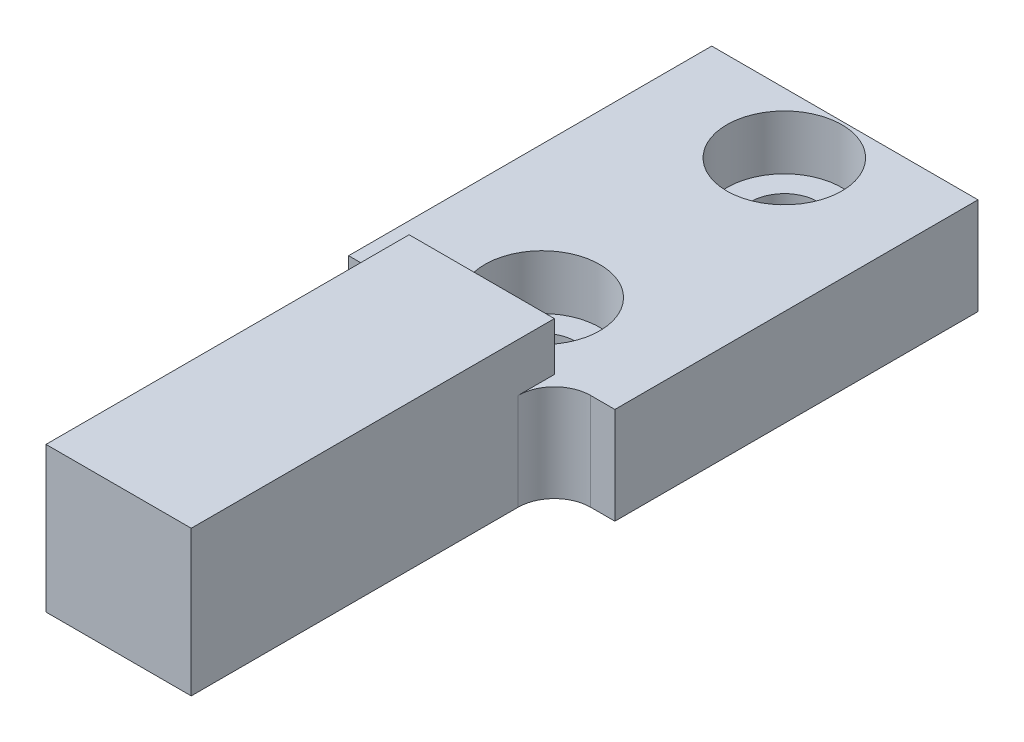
from build123d import *

# Parameters (mm, degrees)
EXTRUDE_1_DEPTH          = 60
SKETCH_2_OUTSIDE_W       = 75.004
SKETCH_2_OUTSIDE_H       = 27.004
CUT_EXTRUDE_1_DEPTH      = 60
CUT_EXTRUDE_2_DEPTH      = 60
CUT_EXTRUDE_2_DEPTH_BACK = 60
SKETCH_3_OUTSIDE_W       = 37.004
SKETCH_3_OUTSIDE_H       = 75.004
SKETCH_3_OUTSIDE_R       = 2.75
SKETCH_4_R               = 4.75
CUT_EXTRUDE_3_DEPTH      = 4.5


with BuildPart() as part:
    # Sketch 1 → Extrude 1 (new body)
    with BuildSketch(Plane.XY):
        Polygon((5, 8), (5, 12), (17, 12), (17, 8), (22, 8), (22, 0), (0, 0), (0, 8), align=None)
    extrude(amount=EXTRUDE_1_DEPTH)

    # Sketch 2 outside → Cut-Extrude 1 (cut)
    with BuildSketch(Plane(origin=(22, 0, 0), x_dir=(0, 0, -1), z_dir=(1, 0, 0))):
        with Locations((-30, 6)):
            Rectangle(SKETCH_2_OUTSIDE_W, SKETCH_2_OUTSIDE_H)
        Polygon((0, 0), (0, 8), (-30, 8), (-30, 12), (-60, 12), (-60, 0), align=None, mode=Mode.SUBTRACT)
    extrude(amount=-CUT_EXTRUDE_1_DEPTH, mode=Mode.SUBTRACT)

    # Sketch 3 outside → Cut-Extrude 2 (cut, two sides: drawn at the far end of the back side and taken through both)
    # profile 1 of 3: a face of its own
    with BuildSketch(Plane(origin=(0, 12, 0), x_dir=(1, 0, 0), z_dir=(0, 1, 0)).offset(-CUT_EXTRUDE_2_DEPTH_BACK)):
        with Locations((11, -30)):
            Rectangle(SKETCH_3_OUTSIDE_W, SKETCH_3_OUTSIDE_H)
        with BuildLine():
            Line((17, -60), (17, -33))
            ThreePointArc((17, -33), (17.878679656, -30.878679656), (20, -30))
            Line((20, -30), (22, -30))
            Line((22, -30), (22, 0))
            Line((22, 0), (0, 0))
            Line((0, 0), (0, -30))
            Line((0, -30), (2, -30))
            ThreePointArc((2, -30), (4.121320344, -30.878679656), (5, -33))
            Line((5, -33), (5, -60))
            Line((5, -60), (17, -60))
        make_face(mode=Mode.SUBTRACT)
    # profile 2 of 3: a face of its own
    with BuildSketch(Plane(origin=(0, 12, 0), x_dir=(1, 0, 0), z_dir=(0, 1, 0)).offset(-CUT_EXTRUDE_2_DEPTH_BACK)):
        with Locations(Location((11, -5, 0), (0, 0, 90))):
            Circle(SKETCH_3_OUTSIDE_R)
    # profile 3 of 3: a face of its own
    with BuildSketch(Plane(origin=(0, 12, 0), x_dir=(1, 0, 0), z_dir=(0, 1, 0)).offset(-CUT_EXTRUDE_2_DEPTH_BACK)):
        with Locations(Location((11, -25, 0), (0, 0, 90))):
            Circle(SKETCH_3_OUTSIDE_R)
    extrude(amount=CUT_EXTRUDE_2_DEPTH + CUT_EXTRUDE_2_DEPTH_BACK, mode=Mode.SUBTRACT)

    # Sketch 4 → Cut-Extrude 3 (cut)
    with BuildSketch(Plane(origin=(0, 8, 0), x_dir=(1, 0, 0), z_dir=(0, 1, 0))):
        with Locations(Location((11, -5, 0), (0, 0, 270))):
            Circle(SKETCH_4_R)
        with Locations(Location((11, -25, 0), (0, 0, 270))):
            Circle(SKETCH_4_R)
    extrude(amount=-CUT_EXTRUDE_3_DEPTH, mode=Mode.SUBTRACT)


solid = part.part
